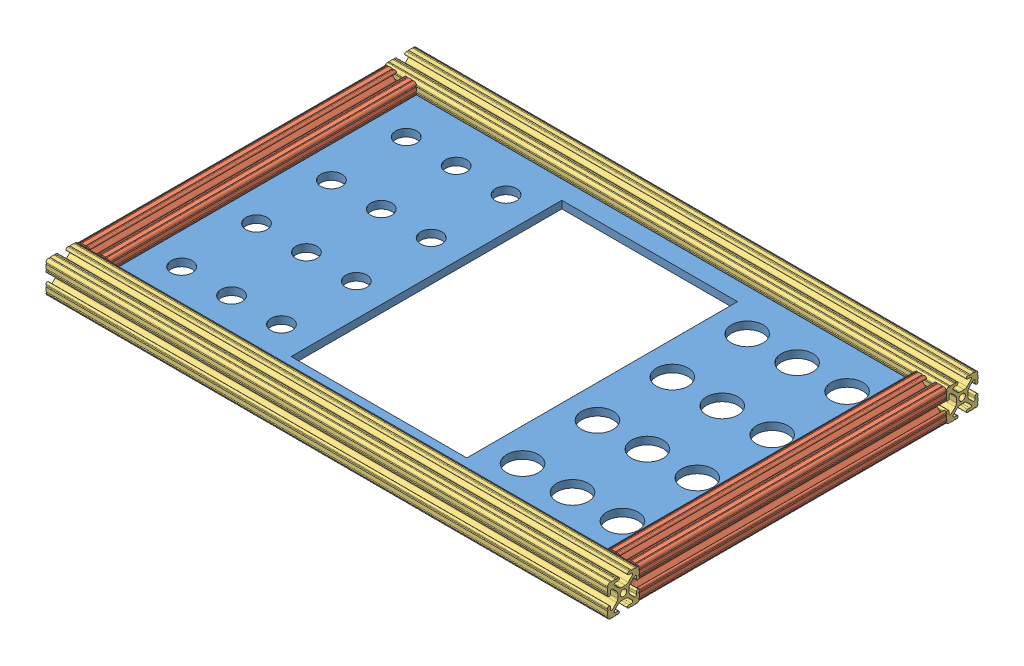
SolidWorks assembly PLC 2.0 assem.SLDASM, configuration Default (file format 12000). Lengths in mm.
Overall size (450 25.4 296.8).
5 component instances, 3 part files, 14 mates.
Components (placement in the parent):
- PLC board 1-1: PLC board 1.SLDPRT [Default] at (61.4816 197.1824 376.6069) size (413.2 6 260)
- 1010 -246mm-1: 1010 -246mm.SLDPRT [ 1010] at (-152.0459 200.181 500.243) size (25.4 25.4 246)
- 1010 -450mm-1: 1010 -450mm.SLDPRT [ 1010] at (285.2541 200.181 241.543) x (0 0 -1) z (1 0 0) size (25.4 25.4 450)
- 1010 -246mm-2: 1010 -246mm.SLDPRT [ 1010] at (272.5541 200.181 500.243) size (25.4 25.4 246)
- 1010 -450mm-3: 1010 -450mm.SLDPRT [ 1010] at (285.2541 200.181 512.943) x (0 -1 0) z (1 0 0) size (25.4 25.4 450)
Mates (geometry in assembly coordinates):
- Coincident2: coincident anti-aligned: plane of 1010 -246mm-1 through (-141.4541 210.7728 254.243) normal (0 0 -1); plane of 1010 -450mm-1 through (-164.7459 209.7314 254.243) normal (0 0 1)
- Coincident3: coincident: point of 1010 -246mm-1; point of 1010 -450mm-1
- Coincident5: coincident: point of 1010 -246mm-1; point of 1010 -450mm-1
- Coincident6: coincident: point of 1010 -450mm-1; point of 1010 -246mm-2
- Coincident7: coincident: point of 1010 -450mm-1; point of 1010 -246mm-2
- Coincident8: coincident anti-aligned: plane of 1010 -450mm-1 through (-164.7459 209.7314 254.243) normal (0 0 1); plane of 1010 -246mm-2 through (283.1459 210.7728 254.243) normal (0 0 -1)
- Coincident9: coincident: point of 1010 -246mm-1; point of 1010 -450mm-3
- Coincident10: coincident: point of 1010 -246mm-1; point of 1010 -450mm-3
- Coincident11: coincident anti-aligned: plane of 1010 -246mm-1 through (-141.4541 210.7728 500.243) normal (0 0 1); plane of 1010 -450mm-3 through (-164.7459 206.5056 500.243) normal (0 0 -1)
- Coincident12: coincident: point of 1010 -246mm-2; point of 1010 -450mm-3
- Coincident13: coincident: point of 1010 -246mm-2; point of 1010 -450mm-3
- Coincident14: coincident anti-aligned: plane of 1010 -246mm-2 through (283.1459 210.7728 500.243) normal (0 0 1); plane of 1010 -450mm-3 through (-164.7459 190.6306 500.243) normal (0 0 -1)
- Parallel2: parallel anti-aligned: line of PLC board 1-1 through (268.0816 203.1824 246.6069) axis (-1 0 0); line of 1010 -450mm-1 through (-164.7459 201.8206 246.0601) axis (1 0 0)
- Parallel3: parallel aligned: line of PLC board 1-1 through (-145.1184 197.1824 506.6069) axis (1 0 0); line of 1010 -450mm-3 through (-164.7459 198.5415 508.4258) axis (1 0 0)
